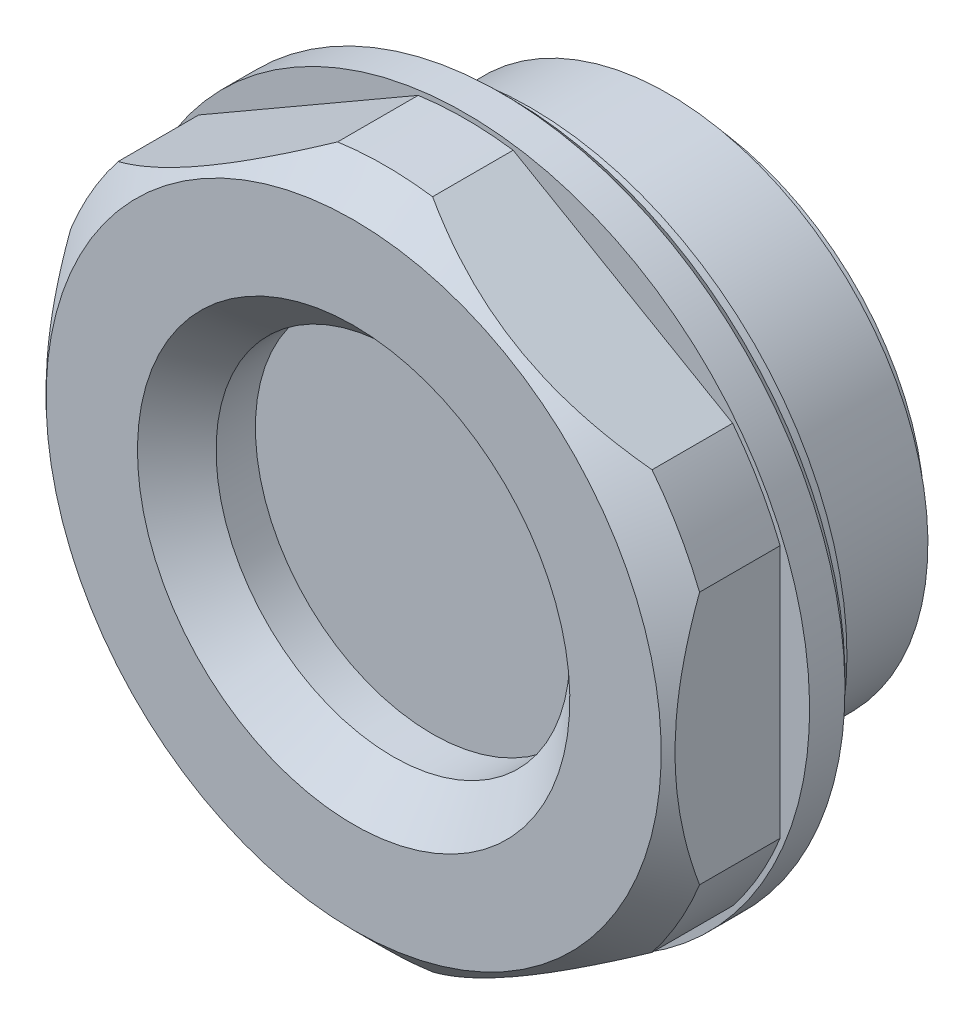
ISO-10303-21;
HEADER;
FILE_DESCRIPTION(('STEP AP214'),'2;1');
FILE_NAME('part.step','',(''),(''),'','','');
FILE_SCHEMA(('AUTOMOTIVE_DESIGN { 1 0 10303 214 1 1 1 1 }'));
ENDSEC;
DATA;
#1=APPLICATION_CONTEXT('core data for automotive mechanical design processes');
#2=APPLICATION_PROTOCOL_DEFINITION('international standard','automotive_design',2000,#1);
#3=PRODUCT_CONTEXT('',#1,'mechanical');
#4=PRODUCT('Part','Part','',(#3));
#5=PRODUCT_RELATED_PRODUCT_CATEGORY('part','',(#4));
#6=PRODUCT_DEFINITION_FORMATION('','',#4);
#7=PRODUCT_DEFINITION_CONTEXT('part definition',#1,'design');
#8=PRODUCT_DEFINITION('design','',#6,#7);
#9=PRODUCT_DEFINITION_SHAPE('','',#8);
#10=(LENGTH_UNIT() NAMED_UNIT(*) SI_UNIT(.MILLI.,.METRE.));
#11=(NAMED_UNIT(*) PLANE_ANGLE_UNIT() SI_UNIT($,.RADIAN.));
#12=(NAMED_UNIT(*) SI_UNIT($,.STERADIAN.) SOLID_ANGLE_UNIT());
#13=UNCERTAINTY_MEASURE_WITH_UNIT(LENGTH_MEASURE(1.E-05),#10,'distance_accuracy_value','');
#14=(GEOMETRIC_REPRESENTATION_CONTEXT(3) GLOBAL_UNCERTAINTY_ASSIGNED_CONTEXT((#13)) GLOBAL_UNIT_ASSIGNED_CONTEXT((#10,
#11,#12)) REPRESENTATION_CONTEXT('',''));
#15=CARTESIAN_POINT('',(0.,0.,0.));
#16=DIRECTION('',(0.,0.,1.));
#17=DIRECTION('',(1.,0.,0.));
#18=AXIS2_PLACEMENT_3D('',#15,#16,#17);
#19=CARTESIAN_POINT('',(0.,0.,-11.967764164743));
#20=DIRECTION('',(0.,0.,-1.));
#21=DIRECTION('',(0.,-1.,0.));
#22=AXIS2_PLACEMENT_3D('',#19,#20,#21);
#23=CYLINDRICAL_SURFACE('',#22,17.25);
#24=CARTESIAN_POINT('',(0.,0.,7.4));
#25=DIRECTION('',(0.,0.,-1.));
#26=DIRECTION('',(0.,-1.,0.));
#27=AXIS2_PLACEMENT_3D('',#24,#25,#26);
#28=CIRCLE('',#27,17.25);
#29=CARTESIAN_POINT('',(-2.41682210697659,17.0798557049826,7.40000000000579));
#30=VERTEX_POINT('',#29);
#31=CARTESIAN_POINT('',(2.41682210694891,17.0798557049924,7.4));
#32=VERTEX_POINT('',#31);
#33=EDGE_CURVE('E365',#30,#32,#28,.T.);
#34=ORIENTED_EDGE('',*,*,#33,.T.);
#35=DIRECTION('',(0.,0.,1.));
#36=VECTOR('',#35,1.);
#37=CARTESIAN_POINT('',(2.41682210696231,17.0798557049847,3.3));
#38=LINE('',#37,#36);
#39=CARTESIAN_POINT('',(2.41682210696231,17.0798557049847,3.3));
#40=VERTEX_POINT('',#39);
#41=EDGE_CURVE('E134',#40,#32,#38,.T.);
#42=ORIENTED_EDGE('',*,*,#41,.F.);
#43=CARTESIAN_POINT('',(0.,0.,3.2999999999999));
#44=DIRECTION('',(0.,0.,-1.));
#45=DIRECTION('',(0.,-1.,0.));
#46=AXIS2_PLACEMENT_3D('',#43,#44,#45);
#47=CIRCLE('',#46,17.25);
#48=CARTESIAN_POINT('',(-2.41682210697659,17.0798557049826,3.3));
#49=VERTEX_POINT('',#48);
#50=EDGE_CURVE('E127',#49,#40,#47,.T.);
#51=ORIENTED_EDGE('',*,*,#50,.F.);
#52=DIRECTION('',(0.,0.,1.));
#53=VECTOR('',#52,1.);
#54=CARTESIAN_POINT('',(-2.41682210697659,17.0798557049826,3.3));
#55=LINE('',#54,#53);
#56=EDGE_CURVE('E107',#49,#30,#55,.T.);
#57=ORIENTED_EDGE('',*,*,#56,.T.);
#58=EDGE_LOOP('',(#34,#42,#51,#57));
#59=FACE_BOUND('',#58,.T.);
#60=ADVANCED_FACE('F14',(#59),#23,.T.);
#61=CARTESIAN_POINT('',(13.5831778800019,10.6329571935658,3.3));
#62=VERTEX_POINT('',#61);
#63=CARTESIAN_POINT('',(15.9999999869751,6.44689851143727,3.3));
#64=VERTEX_POINT('',#63);
#65=EDGE_CURVE('E135',#62,#64,#47,.T.);
#66=ORIENTED_EDGE('',*,*,#65,.F.);
#67=DIRECTION('',(0.,0.,1.));
#68=VECTOR('',#67,1.);
#69=CARTESIAN_POINT('',(13.5831778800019,10.6329571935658,3.3));
#70=LINE('',#69,#68);
#71=CARTESIAN_POINT('',(13.5831778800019,10.6329571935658,7.4000000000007));
#72=VERTEX_POINT('',#71);
#73=EDGE_CURVE('E324',#62,#72,#70,.T.);
#74=ORIENTED_EDGE('',*,*,#73,.T.);
#75=CARTESIAN_POINT('',(15.9999999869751,6.44689851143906,7.4));
#76=VERTEX_POINT('',#75);
#77=EDGE_CURVE('E362',#72,#76,#28,.T.);
#78=ORIENTED_EDGE('',*,*,#77,.T.);
#79=DIRECTION('',(0.,0.,1.));
#80=VECTOR('',#79,1.);
#81=CARTESIAN_POINT('',(15.9999999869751,6.44689851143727,3.3));
#82=LINE('',#81,#80);
#83=EDGE_CURVE('E43',#64,#76,#82,.T.);
#84=ORIENTED_EDGE('',*,*,#83,.F.);
#85=EDGE_LOOP('',(#66,#74,#78,#84));
#86=FACE_BOUND('',#85,.T.);
#87=ADVANCED_FACE('F258',(#86),#23,.T.);
#88=CARTESIAN_POINT('',(15.9999999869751,-6.44689851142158,3.3));
#89=VERTEX_POINT('',#88);
#90=CARTESIAN_POINT('',(13.5831778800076,-10.632957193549,3.3));
#91=VERTEX_POINT('',#90);
#92=EDGE_CURVE('E139',#89,#91,#47,.T.);
#93=ORIENTED_EDGE('',*,*,#92,.F.);
#94=DIRECTION('',(0.,0.,1.));
#95=VECTOR('',#94,1.);
#96=CARTESIAN_POINT('',(15.9999999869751,-6.44689851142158,3.3));
#97=LINE('',#96,#95);
#98=CARTESIAN_POINT('',(15.9999999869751,-6.44689851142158,7.4000000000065));
#99=VERTEX_POINT('',#98);
#100=EDGE_CURVE('E320',#89,#99,#97,.T.);
#101=ORIENTED_EDGE('',*,*,#100,.T.);
#102=CARTESIAN_POINT('',(13.5831778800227,-10.6329571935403,7.4));
#103=VERTEX_POINT('',#102);
#104=EDGE_CURVE('E359',#99,#103,#28,.T.);
#105=ORIENTED_EDGE('',*,*,#104,.T.);
#106=DIRECTION('',(0.,0.,1.));
#107=VECTOR('',#106,1.);
#108=CARTESIAN_POINT('',(13.5831778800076,-10.632957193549,3.3));
#109=LINE('',#108,#107);
#110=EDGE_CURVE('E35',#91,#103,#109,.T.);
#111=ORIENTED_EDGE('',*,*,#110,.F.);
#112=EDGE_LOOP('',(#93,#101,#105,#111));
#113=FACE_BOUND('',#112,.T.);
#114=ADVANCED_FACE('F263',(#113),#23,.T.);
#115=CARTESIAN_POINT('',(2.41682210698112,-17.0798557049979,3.3));
#116=VERTEX_POINT('',#115);
#117=CARTESIAN_POINT('',(-2.41682210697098,-17.0798557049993,3.3));
#118=VERTEX_POINT('',#117);
#119=EDGE_CURVE('E140',#116,#118,#47,.T.);
#120=ORIENTED_EDGE('',*,*,#119,.F.);
#121=DIRECTION('',(0.,0.,1.));
#122=VECTOR('',#121,1.);
#123=CARTESIAN_POINT('',(2.41682210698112,-17.0798557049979,3.3));
#124=LINE('',#123,#122);
#125=CARTESIAN_POINT('',(2.41682210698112,-17.0798557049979,7.3999999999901));
#126=VERTEX_POINT('',#125);
#127=EDGE_CURVE('E316',#116,#126,#124,.T.);
#128=ORIENTED_EDGE('',*,*,#127,.T.);
#129=CARTESIAN_POINT('',(-2.41682210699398,-17.079855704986,7.4));
#130=VERTEX_POINT('',#129);
#131=EDGE_CURVE('E144',#126,#130,#28,.T.);
#132=ORIENTED_EDGE('',*,*,#131,.T.);
#133=DIRECTION('',(0.,0.,1.));
#134=VECTOR('',#133,1.);
#135=CARTESIAN_POINT('',(-2.41682210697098,-17.0798557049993,3.3));
#136=LINE('',#135,#134);
#137=EDGE_CURVE('E314',#118,#130,#136,.T.);
#138=ORIENTED_EDGE('',*,*,#137,.F.);
#139=EDGE_LOOP('',(#120,#128,#132,#138));
#140=FACE_BOUND('',#139,.T.);
#141=ADVANCED_FACE('F276',(#140),#23,.T.);
#142=CARTESIAN_POINT('',(-13.583177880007,-10.6329571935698,3.3));
#143=VERTEX_POINT('',#142);
#144=CARTESIAN_POINT('',(-15.9999999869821,-6.44689851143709,3.3));
#145=VERTEX_POINT('',#144);
#146=EDGE_CURVE('E137',#143,#145,#47,.T.);
#147=ORIENTED_EDGE('',*,*,#146,.F.);
#148=DIRECTION('',(0.,0.,1.));
#149=VECTOR('',#148,1.);
#150=CARTESIAN_POINT('',(-13.583177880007,-10.6329571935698,3.3));
#151=LINE('',#150,#149);
#152=CARTESIAN_POINT('',(-13.583177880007,-10.6329571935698,7.39999999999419));
#153=VERTEX_POINT('',#152);
#154=EDGE_CURVE('E291',#143,#153,#151,.T.);
#155=ORIENTED_EDGE('',*,*,#154,.T.);
#156=CARTESIAN_POINT('',(-15.9999999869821,-6.44689851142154,7.4));
#157=VERTEX_POINT('',#156);
#158=EDGE_CURVE('E143',#153,#157,#28,.T.);
#159=ORIENTED_EDGE('',*,*,#158,.T.);
#160=DIRECTION('',(0.,0.,1.));
#161=VECTOR('',#160,1.);
#162=CARTESIAN_POINT('',(-15.9999999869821,-6.44689851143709,3.3));
#163=LINE('',#162,#161);
#164=EDGE_CURVE('E293',#145,#157,#163,.T.);
#165=ORIENTED_EDGE('',*,*,#164,.F.);
#166=EDGE_LOOP('',(#147,#155,#159,#165));
#167=FACE_BOUND('',#166,.T.);
#168=ADVANCED_FACE('F268',(#167),#23,.T.);
#169=CARTESIAN_POINT('',(-17.,0.,0.999999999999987));
#170=DIRECTION('',(0.,0.,1.));
#171=DIRECTION('',(0.,1.,0.));
#172=AXIS2_PLACEMENT_3D('',#169,#170,#171);
#173=PLANE('',#172);
#174=CARTESIAN_POINT('',(0.,0.,0.999999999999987));
#175=DIRECTION('',(0.,0.,-1.));
#176=DIRECTION('',(0.,-1.,0.));
#177=AXIS2_PLACEMENT_3D('',#174,#175,#176);
#178=CIRCLE('',#177,16.1);
#179=CARTESIAN_POINT('',(0.,-16.1,0.999999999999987));
#180=VERTEX_POINT('',#179);
#181=EDGE_CURVE('E337',#180,#180,#178,.T.);
#182=ORIENTED_EDGE('',*,*,#181,.F.);
#183=EDGE_LOOP('',(#182));
#184=FACE_BOUND('',#183,.T.);
#185=CARTESIAN_POINT('',(0.,0.,0.999999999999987));
#186=DIRECTION('',(0.,0.,-1.));
#187=DIRECTION('',(0.,-1.,0.));
#188=AXIS2_PLACEMENT_3D('',#185,#186,#187);
#189=CIRCLE('',#188,17.);
#190=CARTESIAN_POINT('',(0.,-17.,0.999999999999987));
#191=VERTEX_POINT('',#190);
#192=EDGE_CURVE('E152',#191,#191,#189,.T.);
#193=ORIENTED_EDGE('',*,*,#192,.T.);
#194=EDGE_LOOP('',(#193));
#195=FACE_BOUND('',#194,.T.);
#196=ADVANCED_FACE('F16',(#184,#195),#173,.F.);
#197=CARTESIAN_POINT('',(0.,0.,0.999999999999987));
#198=DIRECTION('',(0.,0.,1.));
#199=DIRECTION('',(0.,1.,0.));
#200=AXIS2_PLACEMENT_3D('',#197,#198,#199);
#201=CONICAL_SURFACE('',#200,17.,0.785398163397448);
#202=CARTESIAN_POINT('',(0.,0.,1.49999999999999));
#203=DIRECTION('',(0.,0.,-1.));
#204=DIRECTION('',(0.,-1.,0.));
#205=AXIS2_PLACEMENT_3D('',#202,#203,#204);
#206=CIRCLE('',#205,17.5);
#207=CARTESIAN_POINT('',(0.,-17.5,1.49999999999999));
#208=VERTEX_POINT('',#207);
#209=EDGE_CURVE('E149',#208,#208,#206,.T.);
#210=ORIENTED_EDGE('',*,*,#209,.T.);
#211=EDGE_LOOP('',(#210));
#212=FACE_BOUND('',#211,.T.);
#213=ORIENTED_EDGE('',*,*,#192,.F.);
#214=EDGE_LOOP('',(#213));
#215=FACE_BOUND('',#214,.T.);
#216=ADVANCED_FACE('F283',(#212,#215),#201,.T.);
#217=CARTESIAN_POINT('',(0.,0.,-11.967764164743));
#218=DIRECTION('',(0.,0.,-1.));
#219=DIRECTION('',(0.,-1.,0.));
#220=AXIS2_PLACEMENT_3D('',#217,#218,#219);
#221=CYLINDRICAL_SURFACE('',#220,17.5);
#222=ORIENTED_EDGE('',*,*,#209,.F.);
#223=EDGE_LOOP('',(#222));
#224=FACE_BOUND('',#223,.T.);
#225=CARTESIAN_POINT('',(0.,0.,3.3));
#226=DIRECTION('',(0.,0.,-1.));
#227=DIRECTION('',(0.,-1.,0.));
#228=AXIS2_PLACEMENT_3D('',#225,#226,#227);
#229=CIRCLE('',#228,17.5);
#230=CARTESIAN_POINT('',(0.,-17.5,3.3));
#231=VERTEX_POINT('',#230);
#232=EDGE_CURVE('E146',#231,#231,#229,.T.);
#233=ORIENTED_EDGE('',*,*,#232,.T.);
#234=EDGE_LOOP('',(#233));
#235=FACE_BOUND('',#234,.T.);
#236=ADVANCED_FACE('F273',(#224,#235),#221,.T.);
#237=CARTESIAN_POINT('',(-17.25,0.,3.2999999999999));
#238=DIRECTION('',(0.,0.,-1.));
#239=DIRECTION('',(0.,-1.,0.));
#240=AXIS2_PLACEMENT_3D('',#237,#238,#239);
#241=PLANE('',#240);
#242=ORIENTED_EDGE('',*,*,#232,.F.);
#243=EDGE_LOOP('',(#242));
#244=FACE_BOUND('',#243,.T.);
#245=ORIENTED_EDGE('',*,*,#119,.T.);
#246=DIRECTION('',(-0.866025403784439,0.5,0.));
#247=VECTOR('',#246,1.);
#248=CARTESIAN_POINT('',(-2.41682210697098,-17.0798557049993,3.3));
#249=LINE('',#248,#247);
#250=EDGE_CURVE('E295',#118,#143,#249,.T.);
#251=ORIENTED_EDGE('',*,*,#250,.T.);
#252=ORIENTED_EDGE('',*,*,#146,.T.);
#253=DIRECTION('',(0.,1.,0.));
#254=VECTOR('',#253,1.);
#255=CARTESIAN_POINT('',(-15.9999999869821,-6.44689851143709,3.3));
#256=LINE('',#255,#254);
#257=CARTESIAN_POINT('',(-15.9999999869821,6.44689851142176,3.3));
#258=VERTEX_POINT('',#257);
#259=EDGE_CURVE('E131',#145,#258,#256,.T.);
#260=ORIENTED_EDGE('',*,*,#259,.T.);
#261=CARTESIAN_POINT('',(-13.5831778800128,10.632957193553,3.3));
#262=VERTEX_POINT('',#261);
#263=EDGE_CURVE('E130',#258,#262,#47,.T.);
#264=ORIENTED_EDGE('',*,*,#263,.T.);
#265=DIRECTION('',(0.866025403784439,0.5,0.));
#266=VECTOR('',#265,1.);
#267=CARTESIAN_POINT('',(-13.5831778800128,10.632957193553,3.3));
#268=LINE('',#267,#266);
#269=EDGE_CURVE('E110',#262,#49,#268,.T.);
#270=ORIENTED_EDGE('',*,*,#269,.T.);
#271=ORIENTED_EDGE('',*,*,#50,.T.);
#272=DIRECTION('',(0.866025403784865,-0.499999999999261,0.));
#273=VECTOR('',#272,1.);
#274=CARTESIAN_POINT('',(2.41682210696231,17.0798557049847,3.3));
#275=LINE('',#274,#273);
#276=EDGE_CURVE('E119',#40,#62,#275,.T.);
#277=ORIENTED_EDGE('',*,*,#276,.T.);
#278=ORIENTED_EDGE('',*,*,#65,.T.);
#279=DIRECTION('',(0.,-1.,0.));
#280=VECTOR('',#279,1.);
#281=CARTESIAN_POINT('',(15.9999999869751,6.44689851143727,3.3));
#282=LINE('',#281,#280);
#283=EDGE_CURVE('E301',#64,#89,#282,.T.);
#284=ORIENTED_EDGE('',*,*,#283,.T.);
#285=ORIENTED_EDGE('',*,*,#92,.T.);
#286=DIRECTION('',(-0.866025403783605,-0.500000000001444,0.));
#287=VECTOR('',#286,1.);
#288=CARTESIAN_POINT('',(13.5831778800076,-10.632957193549,3.3));
#289=LINE('',#288,#287);
#290=EDGE_CURVE('E299',#91,#116,#289,.T.);
#291=ORIENTED_EDGE('',*,*,#290,.T.);
#292=EDGE_LOOP('',(#245,#251,#252,#260,#264,#270,#271,#277,#278,#284,#285,#291));
#293=FACE_BOUND('',#292,.T.);
#294=ADVANCED_FACE('F125',(#244,#293),#241,.F.);
#295=ORIENTED_EDGE('',*,*,#263,.F.);
#296=DIRECTION('',(0.,0.,1.));
#297=VECTOR('',#296,1.);
#298=CARTESIAN_POINT('',(-15.9999999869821,6.44689851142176,3.3));
#299=LINE('',#298,#297);
#300=CARTESIAN_POINT('',(-15.9999999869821,6.44689851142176,7.39999999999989));
#301=VERTEX_POINT('',#300);
#302=EDGE_CURVE('E309',#258,#301,#299,.T.);
#303=ORIENTED_EDGE('',*,*,#302,.T.);
#304=CARTESIAN_POINT('',(-13.5831778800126,10.6329571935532,7.4));
#305=VERTEX_POINT('',#304);
#306=EDGE_CURVE('E363',#301,#305,#28,.T.);
#307=ORIENTED_EDGE('',*,*,#306,.T.);
#308=DIRECTION('',(0.,0.,1.));
#309=VECTOR('',#308,1.);
#310=CARTESIAN_POINT('',(-13.5831778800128,10.6329571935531,3.3));
#311=LINE('',#310,#309);
#312=EDGE_CURVE('E118',#262,#305,#311,.T.);
#313=ORIENTED_EDGE('',*,*,#312,.F.);
#314=EDGE_LOOP('',(#295,#303,#307,#313));
#315=FACE_BOUND('',#314,.T.);
#316=ADVANCED_FACE('F253',(#315),#23,.T.);
#317=CARTESIAN_POINT('',(0.,0.,7.4));
#318=DIRECTION('',(0.,0.,-1.));
#319=DIRECTION('',(0.,-1.,0.));
#320=AXIS2_PLACEMENT_3D('',#317,#318,#319);
#321=CONICAL_SURFACE('',#320,17.25,0.785398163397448);
#322=CARTESIAN_POINT('',(2.41662210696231,17.0799711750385,7.3999136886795));
#323=CARTESIAN_POINT('',(2.64010853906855,16.950941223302,7.49635248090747));
#324=CARTESIAN_POINT('',(2.8649864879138,16.8211078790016,7.58842588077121));
#325=CARTESIAN_POINT('',(3.31760495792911,16.5597884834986,7.76295590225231));
#326=CARTESIAN_POINT('',(3.54534643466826,16.4283018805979,7.84540921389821));
#327=CARTESIAN_POINT('',(4.23375567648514,16.0308486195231,8.07725118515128));
#328=CARTESIAN_POINT('',(4.69863101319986,15.7624527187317,8.2106920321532));
#329=CARTESIAN_POINT('',(5.39409009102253,15.3609292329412,8.37153053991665));
#330=CARTESIAN_POINT('',(5.62145212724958,15.2296617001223,8.41807301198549));
#331=CARTESIAN_POINT('',(6.07779717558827,14.9661907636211,8.4988767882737));
#332=CARTESIAN_POINT('',(6.30677993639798,14.8339875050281,8.53313995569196));
#333=CARTESIAN_POINT('',(6.76565039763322,14.5690585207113,8.58879996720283));
#334=CARTESIAN_POINT('',(6.99553675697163,14.4363335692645,8.61021154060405));
#335=CARTESIAN_POINT('',(7.45594854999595,14.1705146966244,8.63987121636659));
#336=CARTESIAN_POINT('',(7.68647398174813,14.0374207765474,8.64811935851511));
#337=CARTESIAN_POINT('',(8.15425358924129,13.7673480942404,8.65135309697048));
#338=CARTESIAN_POINT('',(8.39150985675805,13.6303681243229,8.64594886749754));
#339=CARTESIAN_POINT('',(8.86547403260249,13.3567247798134,8.62115122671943));
#340=CARTESIAN_POINT('',(9.10218193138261,13.2200614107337,8.60175757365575));
#341=CARTESIAN_POINT('',(9.57475962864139,12.9472185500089,8.54929708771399));
#342=CARTESIAN_POINT('',(9.81062796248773,12.8110399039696,8.51621274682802));
#343=CARTESIAN_POINT('',(10.2807092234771,12.5396383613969,8.43693704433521));
#344=CARTESIAN_POINT('',(10.5149220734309,12.4044155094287,8.39074507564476));
#345=CARTESIAN_POINT('',(10.9899480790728,12.1301591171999,8.28403929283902));
#346=CARTESIAN_POINT('',(11.2306818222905,11.9911714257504,8.22305579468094));
#347=CARTESIAN_POINT('',(11.7095664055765,11.71468728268,8.08872318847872));
#348=CARTESIAN_POINT('',(11.9477169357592,11.5771910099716,8.01537261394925));
#349=CARTESIAN_POINT('',(12.420555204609,11.3041977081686,7.85753304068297));
#350=CARTESIAN_POINT('',(12.655250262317,11.1686964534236,7.77307311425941));
#351=CARTESIAN_POINT('',(13.1215993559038,10.8994496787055,7.5939186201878));
#352=CARTESIAN_POINT('',(13.3532545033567,10.7657035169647,7.49922791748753));
#353=CARTESIAN_POINT('',(13.5833778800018,10.632841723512,7.3999136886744));
#354=B_SPLINE_CURVE_WITH_KNOTS('',3,(#322,#323,#324,#325,#326,#327,#328,#329,#330,#331,#332,
#333,#334,#335,#336,#337,#338,#339,#340,#341,#342,#343,#344,#345,#346,#347,#348,#349,#350,#351,
#352,#353),.UNSPECIFIED.,.F.,.F.,(4,2,2,2,2,2,2,2,2,2,2,2,2,2,2,4),(0.,0.826370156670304,
1.65302380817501,3.30994475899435,4.10960324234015,4.90914033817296,5.70775932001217,
6.50637588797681,7.32805208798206,8.14974248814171,8.97248695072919,9.79526952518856,
10.6487226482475,11.5022770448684,12.353640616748,13.2046836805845),.UNSPECIFIED.);
#355=EDGE_CURVE('E9',#32,#72,#354,.T.);
#356=ORIENTED_EDGE('',*,*,#355,.F.);
#357=ORIENTED_EDGE('',*,*,#33,.F.);
#358=CARTESIAN_POINT('',(-13.5833778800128,10.6328417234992,7.3999136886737));
#359=CARTESIAN_POINT('',(-13.3598914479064,10.761871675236,7.49635248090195));
#360=CARTESIAN_POINT('',(-13.1350134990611,10.8917050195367,7.58842588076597));
#361=CARTESIAN_POINT('',(-12.6823950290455,11.1530244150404,7.76295590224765));
#362=CARTESIAN_POINT('',(-12.4546535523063,11.2845110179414,7.84540921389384));
#363=CARTESIAN_POINT('',(-11.766244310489,11.6819642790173,8.07725118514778));
#364=CARTESIAN_POINT('',(-11.301368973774,11.9503601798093,8.21069203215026));
#365=CARTESIAN_POINT('',(-10.605909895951,12.3518836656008,8.37153053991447));
#366=CARTESIAN_POINT('',(-10.3785478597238,12.4831511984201,8.41807301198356));
#367=CARTESIAN_POINT('',(-9.92220281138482,12.7466221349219,8.49887678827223));
#368=CARTESIAN_POINT('',(-9.69322005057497,12.8788253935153,8.53313995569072));
#369=CARTESIAN_POINT('',(-9.23434958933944,13.1437543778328,8.58879996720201));
#370=CARTESIAN_POINT('',(-9.00446323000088,13.2764793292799,8.61021154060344));
#371=CARTESIAN_POINT('',(-8.54405143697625,13.5422982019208,8.63987121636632));
#372=CARTESIAN_POINT('',(-8.31352600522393,13.675392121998,8.64811935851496));
#373=CARTESIAN_POINT('',(-7.8457463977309,13.9454648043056,8.65135309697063));
#374=CARTESIAN_POINT('',(-7.60849013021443,14.0824447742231,8.6459488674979));
#375=CARTESIAN_POINT('',(-7.13452595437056,14.3560881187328,8.62115122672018));
#376=CARTESIAN_POINT('',(-6.89781805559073,14.4927514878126,8.60175757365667));
#377=CARTESIAN_POINT('',(-6.42524035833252,14.7655943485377,8.54929708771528));
#378=CARTESIAN_POINT('',(-6.18937202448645,14.901772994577,8.51621274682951));
#379=CARTESIAN_POINT('',(-5.71929076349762,15.1731745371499,8.43693704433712));
#380=CARTESIAN_POINT('',(-5.48507791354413,15.3083973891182,8.39074507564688));
#381=CARTESIAN_POINT('',(-5.01005190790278,15.5826537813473,8.28403929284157));
#382=CARTESIAN_POINT('',(-4.76931816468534,15.7216414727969,8.22305579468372));
#383=CARTESIAN_POINT('',(-4.29043358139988,15.9981256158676,8.08872318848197));
#384=CARTESIAN_POINT('',(-4.05228305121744,16.1356218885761,8.01537261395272));
#385=CARTESIAN_POINT('',(-3.57944478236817,16.4086151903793,7.85753304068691));
#386=CARTESIAN_POINT('',(-3.34474972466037,16.5441164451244,7.77307311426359));
#387=CARTESIAN_POINT('',(-2.87840063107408,16.8133632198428,7.59391862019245));
#388=CARTESIAN_POINT('',(-2.64674548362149,16.9471093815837,7.4992279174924));
#389=CARTESIAN_POINT('',(-2.4166221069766,17.0799711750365,7.3999136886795));
#390=B_SPLINE_CURVE_WITH_KNOTS('',3,(#358,#359,#360,#361,#362,#363,#364,#365,#366,#367,#368,
#369,#370,#371,#372,#373,#374,#375,#376,#377,#378,#379,#380,#381,#382,#383,#384,#385,#386,#387,
#388,#389),.UNSPECIFIED.,.F.,.F.,(4,2,2,2,2,2,2,2,2,2,2,2,2,2,2,4),(0.,0.826370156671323,
1.65302380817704,3.30994475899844,4.1096032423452,4.90914033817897,5.70775932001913,
6.50637588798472,7.32805208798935,8.14974248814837,8.97248695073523,9.79526952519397,
10.6487226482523,11.5022770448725,12.3536406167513,13.2046836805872),.UNSPECIFIED.);
#391=EDGE_CURVE('E113',#305,#30,#390,.T.);
#392=ORIENTED_EDGE('',*,*,#391,.F.);
#393=ORIENTED_EDGE('',*,*,#306,.F.);
#394=CARTESIAN_POINT('',(-15.9999999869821,-12.6812915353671,4.23394860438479));
#395=CARTESIAN_POINT('',(-15.9999999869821,-12.3749485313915,4.42420304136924));
#396=CARTESIAN_POINT('',(-15.9999999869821,-12.066711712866,4.6114544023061));
#397=CARTESIAN_POINT('',(-15.9999999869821,-11.4460179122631,4.9789944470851));
#398=CARTESIAN_POINT('',(-15.9999999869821,-11.1335599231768,5.1592814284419));
#399=CARTESIAN_POINT('',(-15.9999999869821,-10.502783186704,5.51260263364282));
#400=CARTESIAN_POINT('',(-15.9999999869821,-10.1844449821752,5.68560224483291));
#401=CARTESIAN_POINT('',(-15.9999999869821,-9.54289139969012,6.02227359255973));
#402=CARTESIAN_POINT('',(-15.9999999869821,-9.21967633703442,6.18594592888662));
#403=CARTESIAN_POINT('',(-15.9999999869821,-8.5609054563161,6.50600782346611));
#404=CARTESIAN_POINT('',(-15.9999999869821,-8.22523414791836,6.6621613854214));
#405=CARTESIAN_POINT('',(-15.9999999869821,-7.54816854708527,6.9615126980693));
#406=CARTESIAN_POINT('',(-15.9999999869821,-7.20677374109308,7.10470927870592));
#407=CARTESIAN_POINT('',(-15.9999999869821,-6.1748102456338,7.5114663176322));
#408=CARTESIAN_POINT('',(-15.9999999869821,-5.47509987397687,7.7528726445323));
#409=CARTESIAN_POINT('',(-15.9999999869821,-4.36569125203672,8.06949469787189));
#410=CARTESIAN_POINT('',(-15.9999999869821,-3.96345516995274,8.17115409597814));
#411=CARTESIAN_POINT('',(-15.9999999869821,-3.15292379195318,8.34710025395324));
#412=CARTESIAN_POINT('',(-15.9999999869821,-2.74462820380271,8.42138568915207));
#413=CARTESIAN_POINT('',(-15.9999999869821,-1.92758952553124,8.53932550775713));
#414=CARTESIAN_POINT('',(-15.9999999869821,-1.51888819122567,8.58326650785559));
#415=CARTESIAN_POINT('',(-15.9999999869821,-0.699303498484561,8.63994480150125));
#416=CARTESIAN_POINT('',(-15.9999999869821,-0.288420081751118,8.65268125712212));
#417=CARTESIAN_POINT('',(-15.9999999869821,0.606952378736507,8.6458171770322));
#418=CARTESIAN_POINT('',(-15.9999999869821,1.09140484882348,8.61999678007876));
#419=CARTESIAN_POINT('',(-15.9999999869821,2.056132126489,8.52557915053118));
#420=CARTESIAN_POINT('',(-15.9999999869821,2.53640604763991,8.45697305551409));
#421=CARTESIAN_POINT('',(-15.9999999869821,3.49607554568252,8.27938482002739));
#422=CARTESIAN_POINT('',(-15.9999999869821,3.97537082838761,8.1698675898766));
#423=CARTESIAN_POINT('',(-15.9999999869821,4.92428885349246,7.91561840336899));
#424=CARTESIAN_POINT('',(-15.9999999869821,5.39391349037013,7.77089341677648));
#425=CARTESIAN_POINT('',(-15.9999999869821,6.42568499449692,7.41615437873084));
#426=CARTESIAN_POINT('',(-15.9999999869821,6.98528448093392,7.19877933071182));
#427=CARTESIAN_POINT('',(-15.9999999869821,8.08938420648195,6.72827007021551));
#428=CARTESIAN_POINT('',(-15.9999999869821,8.63387583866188,6.47511595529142));
#429=CARTESIAN_POINT('',(-15.9999999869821,9.71074150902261,5.93958912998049));
#430=CARTESIAN_POINT('',(-15.9999999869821,10.243062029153,5.65710970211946));
#431=CARTESIAN_POINT('',(-15.9999999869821,11.2949763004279,5.06975076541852));
#432=CARTESIAN_POINT('',(-15.9999999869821,11.8145724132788,4.76487545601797));
#433=CARTESIAN_POINT('',(-15.9999999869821,12.8190461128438,4.15177653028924));
#434=CARTESIAN_POINT('',(-15.9999999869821,13.304418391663,3.84435895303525));
#435=CARTESIAN_POINT('',(-15.9999999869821,14.2665761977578,3.21632593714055));
#436=CARTESIAN_POINT('',(-15.9999999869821,14.7433609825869,2.8957093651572));
#437=CARTESIAN_POINT('',(-15.9999999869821,15.6851113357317,2.24671013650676));
#438=CARTESIAN_POINT('',(-15.9999999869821,16.1501454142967,1.91842664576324));
#439=CARTESIAN_POINT('',(-15.9999999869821,16.8428799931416,1.41948101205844));
#440=CARTESIAN_POINT('',(-15.9999999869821,17.0729567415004,1.2521030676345));
#441=CARTESIAN_POINT('',(-15.9999999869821,17.5316321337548,0.915343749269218));
#442=CARTESIAN_POINT('',(-15.9999999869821,17.7602308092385,0.745962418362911));
#443=CARTESIAN_POINT('',(-15.9999999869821,17.9881478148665,0.575667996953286));
#444=B_SPLINE_CURVE_WITH_KNOTS('',3,(#394,#395,#396,#397,#398,#399,#400,#401,#402,#403,#404,
#405,#406,#407,#408,#409,#410,#411,#412,#413,#414,#415,#416,#417,#418,#419,#420,#421,#422,#423,
#424,#425,#426,#427,#428,#429,#430,#431,#432,#433,#434,#435,#436,#437,#438,#439,#440,#441,#442,
#443),.UNSPECIFIED.,.F.,.F.,(4,2,2,2,2,2,2,2,2,2,2,2,2,2,2,2,2,2,2,2,2,2,2,2,4),(0.,
1.08186191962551,2.16398665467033,3.25077586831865,4.33749511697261,5.44786323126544,
6.55833151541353,8.77471342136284,10.0185917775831,11.2625303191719,12.4945524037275,
13.7266075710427,15.1799835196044,16.6336606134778,18.1070573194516,19.5801625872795,
21.3795633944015,23.1799691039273,24.9871729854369,26.7940388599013,28.5173926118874,
30.2408946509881,31.9484672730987,32.8020135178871,33.6555414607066),.UNSPECIFIED.);
#445=EDGE_CURVE('E161',#157,#301,#444,.T.);
#446=ORIENTED_EDGE('',*,*,#445,.F.);
#447=ORIENTED_EDGE('',*,*,#158,.F.);
#448=CARTESIAN_POINT('',(-2.41662210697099,-17.0799711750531,7.3999136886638));
#449=CARTESIAN_POINT('',(-2.64010853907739,-16.9509412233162,7.49635248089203));
#450=CARTESIAN_POINT('',(-2.86498648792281,-16.8211078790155,7.58842588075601));
#451=CARTESIAN_POINT('',(-3.31760495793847,-16.5597884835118,7.76295590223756));
#452=CARTESIAN_POINT('',(-3.5453464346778,-16.4283018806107,7.84540921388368));
#453=CARTESIAN_POINT('',(-4.23375567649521,-16.0308486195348,8.07725118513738));
#454=CARTESIAN_POINT('',(-4.69863101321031,-15.7624527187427,8.21069203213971));
#455=CARTESIAN_POINT('',(-5.39409009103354,-15.3609292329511,8.3715305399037));
#456=CARTESIAN_POINT('',(-5.62145212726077,-15.2296617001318,8.41807301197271));
#457=CARTESIAN_POINT('',(-6.07779717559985,-14.9661907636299,8.49887678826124));
#458=CARTESIAN_POINT('',(-6.30677993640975,-14.8339875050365,8.53313995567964));
#459=CARTESIAN_POINT('',(-6.76565039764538,-14.5690585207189,8.58879996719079));
#460=CARTESIAN_POINT('',(-6.99553675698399,-14.4363335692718,8.61021154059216));
#461=CARTESIAN_POINT('',(-7.45594855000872,-14.1705146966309,8.63987121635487));
#462=CARTESIAN_POINT('',(-7.68647398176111,-14.0374207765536,8.64811935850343));
#463=CARTESIAN_POINT('',(-8.15425358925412,-13.7673480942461,8.65135309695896));
#464=CARTESIAN_POINT('',(-8.39150985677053,-13.6303681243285,8.64594886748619));
#465=CARTESIAN_POINT('',(-8.86547403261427,-13.3567247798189,8.62115122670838));
#466=CARTESIAN_POINT('',(-9.10218193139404,-13.2200614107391,8.60175757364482));
#467=CARTESIAN_POINT('',(-9.57475962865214,-12.9472185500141,8.54929708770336));
#468=CARTESIAN_POINT('',(-9.81062796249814,-12.8110399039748,8.51621274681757));
#469=CARTESIAN_POINT('',(-10.2807092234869,-12.539638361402,8.43693704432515));
#470=CARTESIAN_POINT('',(-10.5149220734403,-12.4044155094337,8.39074507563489));
#471=CARTESIAN_POINT('',(-10.9899480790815,-12.1301591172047,8.28403929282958));
#472=CARTESIAN_POINT('',(-11.2306818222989,-11.9911714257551,8.22305579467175));
#473=CARTESIAN_POINT('',(-11.7095664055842,-11.7146872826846,8.08872318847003));
#474=CARTESIAN_POINT('',(-11.9477169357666,-11.5771910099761,8.01537261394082));
#475=CARTESIAN_POINT('',(-12.4205552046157,-11.3041977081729,7.85753304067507));
#476=CARTESIAN_POINT('',(-12.6552502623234,-11.1686964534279,7.7730731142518));
#477=CARTESIAN_POINT('',(-13.1215993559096,-10.8994496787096,7.59391862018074));
#478=CARTESIAN_POINT('',(-13.3532545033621,-10.7657035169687,7.49922791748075));
#479=CARTESIAN_POINT('',(-13.583377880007,-10.632841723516,7.3999136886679));
#480=B_SPLINE_CURVE_WITH_KNOTS('',3,(#448,#449,#450,#451,#452,#453,#454,#455,#456,#457,#458,
#459,#460,#461,#462,#463,#464,#465,#466,#467,#468,#469,#470,#471,#472,#473,#474,#475,#476,#477,
#478,#479),.UNSPECIFIED.,.F.,.F.,(4,2,2,2,2,2,2,2,2,2,2,2,2,2,2,4),(0.,0.82637015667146,
1.65302380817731,3.30994475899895,4.10960324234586,4.90914033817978,5.7077593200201,
6.50637588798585,7.32805208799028,8.14974248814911,8.97248695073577,9.79526952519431,
10.6487226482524,11.5022770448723,12.3536406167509,13.2046836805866),.UNSPECIFIED.);
#481=EDGE_CURVE('E188',#130,#153,#480,.T.);
#482=ORIENTED_EDGE('',*,*,#481,.F.);
#483=ORIENTED_EDGE('',*,*,#131,.F.);
#484=CARTESIAN_POINT('',(13.5833778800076,-10.6328417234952,7.3999136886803));
#485=CARTESIAN_POINT('',(13.3598914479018,-10.7618716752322,7.49635248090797));
#486=CARTESIAN_POINT('',(13.135013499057,-10.891705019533,7.58842588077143));
#487=CARTESIAN_POINT('',(12.6823950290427,-11.153024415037,7.762955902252));
#488=CARTESIAN_POINT('',(12.454653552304,-11.2845110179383,7.84540921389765));
#489=CARTESIAN_POINT('',(11.7662443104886,-11.6819642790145,8.07725118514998));
#490=CARTESIAN_POINT('',(11.3013689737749,-11.9503601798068,8.2106920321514));
#491=CARTESIAN_POINT('',(10.6059098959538,-12.3518836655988,8.37153053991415));
#492=CARTESIAN_POINT('',(10.3785478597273,-12.4831511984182,8.41807301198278));
#493=CARTESIAN_POINT('',(9.92220281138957,-12.7466221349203,8.49887678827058));
#494=CARTESIAN_POINT('',(9.69322005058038,-12.8788253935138,8.53313995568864));
#495=CARTESIAN_POINT('',(9.23434958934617,-13.1437543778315,8.58879996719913));
#496=CARTESIAN_POINT('',(9.00446323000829,-13.2764793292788,8.61021154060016));
#497=CARTESIAN_POINT('',(8.54405143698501,-13.5422982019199,8.63987121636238));
#498=CARTESIAN_POINT('',(8.31352600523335,-13.6753921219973,8.64811935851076));
#499=CARTESIAN_POINT('',(7.84574639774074,-13.9454648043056,8.65135309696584));
#500=CARTESIAN_POINT('',(7.60849013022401,-14.0824447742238,8.64594886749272));
#501=CARTESIAN_POINT('',(7.13452595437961,-14.3560881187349,8.62115122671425));
#502=CARTESIAN_POINT('',(6.89781805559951,-14.4927514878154,8.60175757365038));
#503=CARTESIAN_POINT('',(6.42524035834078,-14.7655943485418,8.5492970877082));
#504=CARTESIAN_POINT('',(6.18937202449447,-14.9017729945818,8.51621274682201));
#505=CARTESIAN_POINT('',(5.71929076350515,-15.173174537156,8.43693704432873));
#506=CARTESIAN_POINT('',(5.48507791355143,-15.308397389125,8.39074507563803));
#507=CARTESIAN_POINT('',(5.0100519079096,-15.5826537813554,8.28403929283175));
#508=CARTESIAN_POINT('',(4.76931816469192,-15.7216414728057,8.2230557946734));
#509=CARTESIAN_POINT('',(4.290433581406,-15.9981256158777,8.08872318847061));
#510=CARTESIAN_POINT('',(4.05228305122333,-16.1356218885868,8.01537261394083));
#511=CARTESIAN_POINT('',(3.57944478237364,-16.4086151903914,7.85753304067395));
#512=CARTESIAN_POINT('',(3.34474972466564,-16.5441164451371,7.77307311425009));
#513=CARTESIAN_POINT('',(2.87840063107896,-16.8133632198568,7.59391862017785));
#514=CARTESIAN_POINT('',(2.64674548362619,-16.9471093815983,7.49922791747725));
#515=CARTESIAN_POINT('',(2.41662210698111,-17.0799711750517,7.3999136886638));
#516=B_SPLINE_CURVE_WITH_KNOTS('',3,(#484,#485,#486,#487,#488,#489,#490,#491,#492,#493,#494,
#495,#496,#497,#498,#499,#500,#501,#502,#503,#504,#505,#506,#507,#508,#509,#510,#511,#512,#513,
#514,#515),.UNSPECIFIED.,.F.,.F.,(4,2,2,2,2,2,2,2,2,2,2,2,2,2,2,4),(0.,0.82637015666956,
1.65302380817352,3.30994475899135,4.10960324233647,4.90914033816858,5.70775932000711,
6.50637588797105,7.32805208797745,8.14974248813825,8.9724869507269,9.79526952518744,
10.6487226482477,11.5022770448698,12.3536406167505,13.2046836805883),.UNSPECIFIED.);
#517=EDGE_CURVE('E194',#103,#126,#516,.T.);
#518=ORIENTED_EDGE('',*,*,#517,.F.);
#519=ORIENTED_EDGE('',*,*,#104,.F.);
#520=CARTESIAN_POINT('',(15.9999999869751,-12.6812915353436,4.23394860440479));
#521=CARTESIAN_POINT('',(15.9999999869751,-12.3749485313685,4.42420304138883));
#522=CARTESIAN_POINT('',(15.9999999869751,-12.0667117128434,4.61145440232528));
#523=CARTESIAN_POINT('',(15.9999999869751,-11.4460179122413,4.97899444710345));
#524=CARTESIAN_POINT('',(15.9999999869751,-11.1335599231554,5.15928142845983));
#525=CARTESIAN_POINT('',(15.9999999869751,-10.5027831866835,5.51260263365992));
#526=CARTESIAN_POINT('',(15.9999999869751,-10.1844449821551,5.68560224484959));
#527=CARTESIAN_POINT('',(15.9999999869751,-9.54289139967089,6.02227359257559));
#528=CARTESIAN_POINT('',(15.9999999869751,-9.21967633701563,6.18594592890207));
#529=CARTESIAN_POINT('',(15.9999999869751,-8.5609054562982,6.50600782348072));
#530=CARTESIAN_POINT('',(15.9999999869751,-8.22523414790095,6.66216138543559));
#531=CARTESIAN_POINT('',(15.9999999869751,-7.54816854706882,6.96151269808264));
#532=CARTESIAN_POINT('',(15.9999999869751,-7.20677374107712,7.10470927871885));
#533=CARTESIAN_POINT('',(15.9999999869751,-6.17481024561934,7.51146631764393));
#534=CARTESIAN_POINT('',(15.9999999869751,-5.47509987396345,7.75287264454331));
#535=CARTESIAN_POINT('',(15.9999999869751,-4.36569125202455,8.06949469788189));
#536=CARTESIAN_POINT('',(15.9999999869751,-3.96345516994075,8.17115409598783));
#537=CARTESIAN_POINT('',(15.9999999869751,-3.15292379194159,8.34710025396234));
#538=CARTESIAN_POINT('',(15.9999999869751,-2.74462820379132,8.42138568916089));
#539=CARTESIAN_POINT('',(15.9999999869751,-1.92758952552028,8.53932550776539));
#540=CARTESIAN_POINT('',(15.9999999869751,-1.51888819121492,8.58326650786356));
#541=CARTESIAN_POINT('',(15.9999999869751,-0.699303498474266,8.63994480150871));
#542=CARTESIAN_POINT('',(15.9999999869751,-0.288420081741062,8.65268125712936));
#543=CARTESIAN_POINT('',(15.9999999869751,0.606952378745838,8.6458171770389));
#544=CARTESIAN_POINT('',(15.9999999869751,1.09140484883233,8.61999678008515));
#545=CARTESIAN_POINT('',(15.9999999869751,2.05613212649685,8.52557915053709));
#546=CARTESIAN_POINT('',(15.9999999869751,2.53640604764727,8.45697305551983));
#547=CARTESIAN_POINT('',(15.9999999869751,3.49607554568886,8.27938482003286));
#548=CARTESIAN_POINT('',(15.9999999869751,3.97537082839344,8.16986758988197));
#549=CARTESIAN_POINT('',(15.9999999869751,4.92428885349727,7.91561840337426));
#550=CARTESIAN_POINT('',(15.9999999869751,5.39391349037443,7.77089341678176));
#551=CARTESIAN_POINT('',(15.9999999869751,6.42568499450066,7.41615437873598));
#552=CARTESIAN_POINT('',(15.9999999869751,6.98528448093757,7.19877933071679));
#553=CARTESIAN_POINT('',(15.9999999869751,8.08938420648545,6.72827007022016));
#554=CARTESIAN_POINT('',(15.9999999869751,8.63387583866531,6.47511595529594));
#555=CARTESIAN_POINT('',(15.9999999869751,9.7107415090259,5.93958912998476));
#556=CARTESIAN_POINT('',(15.9999999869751,10.2430620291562,5.65710970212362));
#557=CARTESIAN_POINT('',(15.9999999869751,11.294976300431,5.06975076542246));
#558=CARTESIAN_POINT('',(15.9999999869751,11.8145724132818,4.76487545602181));
#559=CARTESIAN_POINT('',(15.9999999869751,12.8190461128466,4.15177653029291));
#560=CARTESIAN_POINT('',(15.9999999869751,13.3044183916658,3.84435895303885));
#561=CARTESIAN_POINT('',(15.9999999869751,14.2665761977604,3.21632593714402));
#562=CARTESIAN_POINT('',(15.9999999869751,14.7433609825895,2.8957093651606));
#563=CARTESIAN_POINT('',(15.9999999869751,15.6851113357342,2.24671013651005));
#564=CARTESIAN_POINT('',(15.9999999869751,16.1501454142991,1.91842664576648));
#565=CARTESIAN_POINT('',(15.9999999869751,16.8428799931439,1.41948101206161));
#566=CARTESIAN_POINT('',(15.9999999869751,17.0729567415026,1.25210306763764));
#567=CARTESIAN_POINT('',(15.9999999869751,17.5316321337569,0.915343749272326));
#568=CARTESIAN_POINT('',(15.9999999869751,17.7602308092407,0.745962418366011));
#569=CARTESIAN_POINT('',(15.9999999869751,17.9881478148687,0.575667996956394));
#570=B_SPLINE_CURVE_WITH_KNOTS('',3,(#520,#521,#522,#523,#524,#525,#526,#527,#528,#529,#530,
#531,#532,#533,#534,#535,#536,#537,#538,#539,#540,#541,#542,#543,#544,#545,#546,#547,#548,#549,
#550,#551,#552,#553,#554,#555,#556,#557,#558,#559,#560,#561,#562,#563,#564,#565,#566,#567,#568,
#569),.UNSPECIFIED.,.F.,.F.,(4,2,2,2,2,2,2,2,2,2,2,2,2,2,2,2,2,2,2,2,2,2,2,2,4),(0.,
1.0818619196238,2.16398665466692,3.25077586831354,4.33749511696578,5.44786323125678,
6.55833151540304,8.77471342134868,10.0185917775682,11.2625303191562,12.4945524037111,
13.7266075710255,15.1799835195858,16.6336606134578,18.1070573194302,19.5801625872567,
21.3795633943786,23.1799691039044,24.9871729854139,26.7940388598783,28.5173926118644,
30.240894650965,31.9484672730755,32.8020135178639,33.6555414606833),.UNSPECIFIED.);
#571=EDGE_CURVE('E28',#76,#99,#570,.F.);
#572=ORIENTED_EDGE('',*,*,#571,.F.);
#573=ORIENTED_EDGE('',*,*,#77,.F.);
#574=EDGE_LOOP('',(#356,#357,#392,#393,#446,#447,#482,#483,#518,#519,#572,#573));
#575=FACE_BOUND('',#574,.T.);
#576=CARTESIAN_POINT('',(0.,0.,9.));
#577=DIRECTION('',(0.,0.,-1.));
#578=DIRECTION('',(0.,-1.,0.));
#579=AXIS2_PLACEMENT_3D('',#576,#577,#578);
#580=CIRCLE('',#579,15.65);
#581=CARTESIAN_POINT('',(0.,-15.65,9.));
#582=VERTEX_POINT('',#581);
#583=EDGE_CURVE('E354',#582,#582,#580,.T.);
#584=ORIENTED_EDGE('',*,*,#583,.T.);
#585=EDGE_LOOP('',(#584));
#586=FACE_BOUND('',#585,.T.);
#587=ADVANCED_FACE('F168',(#575,#586),#321,.T.);
#588=CARTESIAN_POINT('',(-15.65,0.,9.));
#589=DIRECTION('',(0.,0.,1.));
#590=DIRECTION('',(0.,1.,0.));
#591=AXIS2_PLACEMENT_3D('',#588,#589,#590);
#592=PLANE('',#591);
#593=CARTESIAN_POINT('',(0.,0.,9.));
#594=DIRECTION('',(0.,0.,1.));
#595=DIRECTION('',(0.,1.,0.));
#596=AXIS2_PLACEMENT_3D('',#593,#594,#595);
#597=CIRCLE('',#596,11.);
#598=CARTESIAN_POINT('',(0.,11.,9.));
#599=VERTEX_POINT('',#598);
#600=EDGE_CURVE('E334',#599,#599,#597,.T.);
#601=ORIENTED_EDGE('',*,*,#600,.F.);
#602=EDGE_LOOP('',(#601));
#603=FACE_BOUND('',#602,.T.);
#604=ORIENTED_EDGE('',*,*,#583,.F.);
#605=EDGE_LOOP('',(#604));
#606=FACE_BOUND('',#605,.T.);
#607=ADVANCED_FACE('F244',(#603,#606),#592,.T.);
#608=CARTESIAN_POINT('',(-12.0585,0.,-8.));
#609=DIRECTION('',(0.,0.,1.));
#610=DIRECTION('',(0.,1.,0.));
#611=AXIS2_PLACEMENT_3D('',#608,#609,#610);
#612=PLANE('',#611);
#613=CARTESIAN_POINT('',(0.,0.,-8.));
#614=DIRECTION('',(0.,0.,-1.));
#615=DIRECTION('',(0.,-1.,0.));
#616=AXIS2_PLACEMENT_3D('',#613,#614,#615);
#617=CIRCLE('',#616,12.0585);
#618=CARTESIAN_POINT('',(0.,-12.0585,-8.));
#619=VERTEX_POINT('',#618);
#620=EDGE_CURVE('E352',#619,#619,#617,.T.);
#621=ORIENTED_EDGE('',*,*,#620,.T.);
#622=EDGE_LOOP('',(#621));
#623=FACE_BOUND('',#622,.T.);
#624=ADVANCED_FACE('F241',(#623),#612,.F.);
#625=CARTESIAN_POINT('',(0.,0.,-11.967764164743));
#626=DIRECTION('',(0.,0.,-1.));
#627=DIRECTION('',(0.,-1.,0.));
#628=AXIS2_PLACEMENT_3D('',#625,#626,#627);
#629=CYLINDRICAL_SURFACE('',#628,12.0585);
#630=ORIENTED_EDGE('',*,*,#620,.F.);
#631=EDGE_LOOP('',(#630));
#632=FACE_BOUND('',#631,.T.);
#633=CARTESIAN_POINT('',(0.,0.,-7.));
#634=DIRECTION('',(0.,0.,-1.));
#635=DIRECTION('',(0.,-1.,0.));
#636=AXIS2_PLACEMENT_3D('',#633,#634,#635);
#637=CIRCLE('',#636,12.0585);
#638=CARTESIAN_POINT('',(0.,-12.0585,-7.));
#639=VERTEX_POINT('',#638);
#640=EDGE_CURVE('E349',#639,#639,#637,.T.);
#641=ORIENTED_EDGE('',*,*,#640,.T.);
#642=EDGE_LOOP('',(#641));
#643=FACE_BOUND('',#642,.T.);
#644=ADVANCED_FACE('F237',(#632,#643),#629,.T.);
#645=CARTESIAN_POINT('',(-13.2205,0.,-7.));
#646=DIRECTION('',(0.,0.,1.));
#647=DIRECTION('',(0.,1.,0.));
#648=AXIS2_PLACEMENT_3D('',#645,#646,#647);
#649=PLANE('',#648);
#650=ORIENTED_EDGE('',*,*,#640,.F.);
#651=EDGE_LOOP('',(#650));
#652=FACE_BOUND('',#651,.T.);
#653=CARTESIAN_POINT('',(0.,0.,-7.));
#654=DIRECTION('',(0.,0.,-1.));
#655=DIRECTION('',(0.,-1.,0.));
#656=AXIS2_PLACEMENT_3D('',#653,#654,#655);
#657=CIRCLE('',#656,13.2205);
#658=CARTESIAN_POINT('',(0.,-13.2205,-7.));
#659=VERTEX_POINT('',#658);
#660=EDGE_CURVE('E346',#659,#659,#657,.T.);
#661=ORIENTED_EDGE('',*,*,#660,.T.);
#662=EDGE_LOOP('',(#661));
#663=FACE_BOUND('',#662,.T.);
#664=ADVANCED_FACE('F233',(#652,#663),#649,.F.);
#665=CARTESIAN_POINT('',(0.,0.,-11.967764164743));
#666=DIRECTION('',(0.,0.,-1.));
#667=DIRECTION('',(0.,-1.,0.));
#668=AXIS2_PLACEMENT_3D('',#665,#666,#667);
#669=CYLINDRICAL_SURFACE('',#668,13.2205);
#670=ORIENTED_EDGE('',*,*,#660,.F.);
#671=EDGE_LOOP('',(#670));
#672=FACE_BOUND('',#671,.T.);
#673=CARTESIAN_POINT('',(0.,0.,0.));
#674=DIRECTION('',(0.,0.,-1.));
#675=DIRECTION('',(0.,-1.,0.));
#676=AXIS2_PLACEMENT_3D('',#673,#674,#675);
#677=CIRCLE('',#676,13.2205);
#678=CARTESIAN_POINT('',(0.,-13.2205,0.));
#679=VERTEX_POINT('',#678);
#680=EDGE_CURVE('E343',#679,#679,#677,.T.);
#681=ORIENTED_EDGE('',*,*,#680,.T.);
#682=EDGE_LOOP('',(#681));
#683=FACE_BOUND('',#682,.T.);
#684=ADVANCED_FACE('F229',(#672,#683),#669,.T.);
#685=CARTESIAN_POINT('',(-16.1,0.,0.));
#686=DIRECTION('',(0.,0.,1.));
#687=DIRECTION('',(0.,1.,0.));
#688=AXIS2_PLACEMENT_3D('',#685,#686,#687);
#689=PLANE('',#688);
#690=ORIENTED_EDGE('',*,*,#680,.F.);
#691=EDGE_LOOP('',(#690));
#692=FACE_BOUND('',#691,.T.);
#693=CARTESIAN_POINT('',(0.,0.,0.));
#694=DIRECTION('',(0.,0.,-1.));
#695=DIRECTION('',(0.,-1.,0.));
#696=AXIS2_PLACEMENT_3D('',#693,#694,#695);
#697=CIRCLE('',#696,16.1);
#698=CARTESIAN_POINT('',(0.,-16.1,0.));
#699=VERTEX_POINT('',#698);
#700=EDGE_CURVE('E340',#699,#699,#697,.T.);
#701=ORIENTED_EDGE('',*,*,#700,.T.);
#702=EDGE_LOOP('',(#701));
#703=FACE_BOUND('',#702,.T.);
#704=ADVANCED_FACE('F225',(#692,#703),#689,.F.);
#705=CARTESIAN_POINT('',(0.,0.,-11.967764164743));
#706=DIRECTION('',(0.,0.,-1.));
#707=DIRECTION('',(0.,-1.,0.));
#708=AXIS2_PLACEMENT_3D('',#705,#706,#707);
#709=CYLINDRICAL_SURFACE('',#708,16.1);
#710=ORIENTED_EDGE('',*,*,#700,.F.);
#711=EDGE_LOOP('',(#710));
#712=FACE_BOUND('',#711,.T.);
#713=ORIENTED_EDGE('',*,*,#181,.T.);
#714=EDGE_LOOP('',(#713));
#715=FACE_BOUND('',#714,.T.);
#716=ADVANCED_FACE('F221',(#712,#715),#709,.T.);
#717=CARTESIAN_POINT('',(0.,0.,9.));
#718=DIRECTION('',(0.,0.,1.));
#719=DIRECTION('',(0.,1.,0.));
#720=AXIS2_PLACEMENT_3D('',#717,#718,#719);
#721=CONICAL_SURFACE('',#720,11.,0.785398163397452);
#722=CARTESIAN_POINT('',(0.,0.,7.));
#723=DIRECTION('',(0.,0.,1.));
#724=DIRECTION('',(0.,1.,0.));
#725=AXIS2_PLACEMENT_3D('',#722,#723,#724);
#726=CIRCLE('',#725,9.);
#727=CARTESIAN_POINT('',(0.,9.,7.));
#728=VERTEX_POINT('',#727);
#729=EDGE_CURVE('E328',#728,#728,#726,.T.);
#730=ORIENTED_EDGE('',*,*,#729,.F.);
#731=EDGE_LOOP('',(#730));
#732=FACE_BOUND('',#731,.T.);
#733=ORIENTED_EDGE('',*,*,#600,.T.);
#734=EDGE_LOOP('',(#733));
#735=FACE_BOUND('',#734,.T.);
#736=ADVANCED_FACE('F217',(#732,#735),#721,.F.);
#737=CARTESIAN_POINT('',(-9.,0.,5.));
#738=DIRECTION('',(0.,0.,-1.));
#739=DIRECTION('',(0.,-1.,0.));
#740=AXIS2_PLACEMENT_3D('',#737,#738,#739);
#741=PLANE('',#740);
#742=CARTESIAN_POINT('',(0.,0.,5.));
#743=DIRECTION('',(0.,0.,1.));
#744=DIRECTION('',(0.,1.,0.));
#745=AXIS2_PLACEMENT_3D('',#742,#743,#744);
#746=CIRCLE('',#745,9.);
#747=CARTESIAN_POINT('',(0.,9.,5.));
#748=VERTEX_POINT('',#747);
#749=EDGE_CURVE('E331',#748,#748,#746,.T.);
#750=ORIENTED_EDGE('',*,*,#749,.T.);
#751=EDGE_LOOP('',(#750));
#752=FACE_BOUND('',#751,.T.);
#753=ADVANCED_FACE('F213',(#752),#741,.F.);
#754=CARTESIAN_POINT('',(0.,0.,15.5068910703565));
#755=DIRECTION('',(0.,0.,1.));
#756=DIRECTION('',(0.,1.,0.));
#757=AXIS2_PLACEMENT_3D('',#754,#755,#756);
#758=CYLINDRICAL_SURFACE('',#757,9.);
#759=ORIENTED_EDGE('',*,*,#749,.F.);
#760=EDGE_LOOP('',(#759));
#761=FACE_BOUND('',#760,.T.);
#762=ORIENTED_EDGE('',*,*,#729,.T.);
#763=EDGE_LOOP('',(#762));
#764=FACE_BOUND('',#763,.T.);
#765=ADVANCED_FACE('F175',(#761,#764),#758,.F.);
#766=CARTESIAN_POINT('',(-13.5831778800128,10.632957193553,3.3));
#767=DIRECTION('',(0.5,-0.866025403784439,0.));
#768=DIRECTION('',(-0.866025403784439,-0.5,0.));
#769=AXIS2_PLACEMENT_3D('',#766,#767,#768);
#770=PLANE('',#769);
#771=ORIENTED_EDGE('',*,*,#391,.T.);
#772=ORIENTED_EDGE('',*,*,#56,.F.);
#773=ORIENTED_EDGE('',*,*,#269,.F.);
#774=ORIENTED_EDGE('',*,*,#312,.T.);
#775=EDGE_LOOP('',(#771,#772,#773,#774));
#776=FACE_BOUND('',#775,.T.);
#777=ADVANCED_FACE('F109',(#776),#770,.F.);
#778=CARTESIAN_POINT('',(-15.9999999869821,-6.44689851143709,3.3));
#779=DIRECTION('',(1.,0.,0.));
#780=DIRECTION('',(0.,-1.,0.));
#781=AXIS2_PLACEMENT_3D('',#778,#779,#780);
#782=PLANE('',#781);
#783=ORIENTED_EDGE('',*,*,#445,.T.);
#784=ORIENTED_EDGE('',*,*,#302,.F.);
#785=ORIENTED_EDGE('',*,*,#259,.F.);
#786=ORIENTED_EDGE('',*,*,#164,.T.);
#787=EDGE_LOOP('',(#783,#784,#785,#786));
#788=FACE_BOUND('',#787,.T.);
#789=ADVANCED_FACE('F174',(#788),#782,.F.);
#790=CARTESIAN_POINT('',(-2.41682210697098,-17.0798557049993,3.3));
#791=DIRECTION('',(0.5,0.866025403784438,0.));
#792=DIRECTION('',(0.866025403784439,-0.5,0.));
#793=AXIS2_PLACEMENT_3D('',#790,#791,#792);
#794=PLANE('',#793);
#795=ORIENTED_EDGE('',*,*,#481,.T.);
#796=ORIENTED_EDGE('',*,*,#154,.F.);
#797=ORIENTED_EDGE('',*,*,#250,.F.);
#798=ORIENTED_EDGE('',*,*,#137,.T.);
#799=EDGE_LOOP('',(#795,#796,#797,#798));
#800=FACE_BOUND('',#799,.T.);
#801=ADVANCED_FACE('F179',(#800),#794,.F.);
#802=CARTESIAN_POINT('',(13.5831778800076,-10.632957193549,3.3));
#803=DIRECTION('',(-0.500000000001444,0.866025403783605,0.));
#804=DIRECTION('',(0.866025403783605,0.500000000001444,0.));
#805=AXIS2_PLACEMENT_3D('',#802,#803,#804);
#806=PLANE('',#805);
#807=ORIENTED_EDGE('',*,*,#517,.T.);
#808=ORIENTED_EDGE('',*,*,#127,.F.);
#809=ORIENTED_EDGE('',*,*,#290,.F.);
#810=ORIENTED_EDGE('',*,*,#110,.T.);
#811=EDGE_LOOP('',(#807,#808,#809,#810));
#812=FACE_BOUND('',#811,.T.);
#813=ADVANCED_FACE('F184',(#812),#806,.F.);
#814=CARTESIAN_POINT('',(15.9999999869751,6.44689851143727,3.3));
#815=DIRECTION('',(-1.,0.,0.));
#816=DIRECTION('',(0.,1.,0.));
#817=AXIS2_PLACEMENT_3D('',#814,#815,#816);
#818=PLANE('',#817);
#819=ORIENTED_EDGE('',*,*,#571,.T.);
#820=ORIENTED_EDGE('',*,*,#100,.F.);
#821=ORIENTED_EDGE('',*,*,#283,.F.);
#822=ORIENTED_EDGE('',*,*,#83,.T.);
#823=EDGE_LOOP('',(#819,#820,#821,#822));
#824=FACE_BOUND('',#823,.T.);
#825=ADVANCED_FACE('F203',(#824),#818,.F.);
#826=CARTESIAN_POINT('',(2.41682210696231,17.0798557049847,3.3));
#827=DIRECTION('',(-0.499999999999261,-0.866025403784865,0.));
#828=DIRECTION('',(-0.866025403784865,0.499999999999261,0.));
#829=AXIS2_PLACEMENT_3D('',#826,#827,#828);
#830=PLANE('',#829);
#831=ORIENTED_EDGE('',*,*,#355,.T.);
#832=ORIENTED_EDGE('',*,*,#73,.F.);
#833=ORIENTED_EDGE('',*,*,#276,.F.);
#834=ORIENTED_EDGE('',*,*,#41,.T.);
#835=EDGE_LOOP('',(#831,#832,#833,#834));
#836=FACE_BOUND('',#835,.T.);
#837=ADVANCED_FACE('F206',(#836),#830,.F.);
#838=CLOSED_SHELL('',(#60,#87,#114,#141,#168,#196,#216,#236,#294,#316,#587,#607,#624,#644,#664,
#684,#704,#716,#736,#753,#765,#777,#789,#801,#813,#825,#837));
#839=MANIFOLD_SOLID_BREP('B1',#838);
#840=ADVANCED_BREP_SHAPE_REPRESENTATION('',(#18,#839),#14);
#841=SHAPE_DEFINITION_REPRESENTATION(#9,#840);
ENDSEC;
END-ISO-10303-21;
